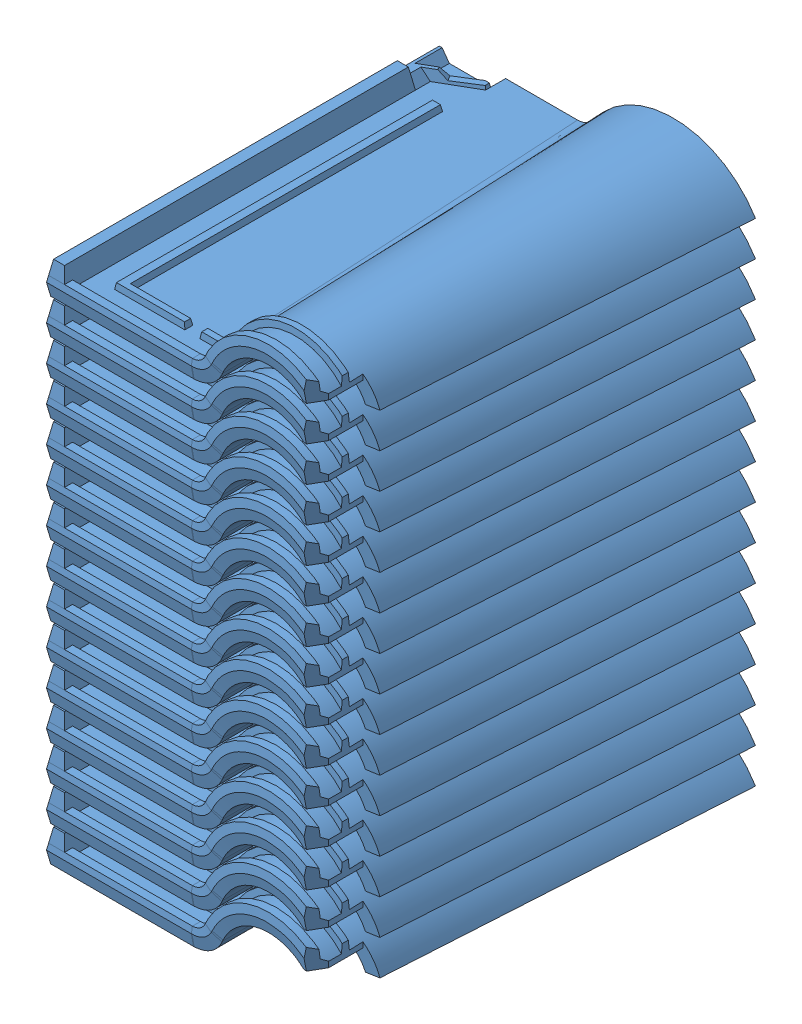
SolidWorks assembly empilage 15 tuiles.SLDASM, configuration Défaut (file format 8000). Lengths in mm.
Overall size (301.93 601.67 406.76).
15 component instances, 1 part files, 3 mates.
Components (placement in the parent):
- tuile_canal_1-1: tuile_canal_1.SLDPRT [Défaut] at (75.9406 -7.5683 406.7628) size (301.93 111.67 406.76)
- tuile_canal_1-2: tuile_canal_1.SLDPRT [Défaut] at (75.9406 -42.5683 406.7628) size (301.93 111.67 406.76)
- tuile_canal_1-3: tuile_canal_1.SLDPRT [Défaut] at (75.9406 -77.5683 406.7628) size (301.93 111.67 406.76)
- tuile_canal_1-4: tuile_canal_1.SLDPRT [Défaut] at (75.9406 -112.5683 406.7628) size (301.93 111.67 406.76)
- tuile_canal_1-5: tuile_canal_1.SLDPRT [Défaut] at (75.9406 -147.5683 406.7628) size (301.93 111.67 406.76)
- tuile_canal_1-6: tuile_canal_1.SLDPRT [Défaut] at (75.9406 -182.5683 406.7628) size (301.93 111.67 406.76)
- tuile_canal_1-7: tuile_canal_1.SLDPRT [Défaut] at (75.9406 -217.5683 406.7628) size (301.93 111.67 406.76)
- tuile_canal_1-8: tuile_canal_1.SLDPRT [Défaut] at (75.9406 -252.5683 406.7628) size (301.93 111.67 406.76)
- tuile_canal_1-9: tuile_canal_1.SLDPRT [Défaut] at (75.9406 -287.5683 406.7628) size (301.93 111.67 406.76)
- tuile_canal_1-10: tuile_canal_1.SLDPRT [Défaut] at (75.9406 -322.5683 406.7628) size (301.93 111.67 406.76)
- tuile_canal_1-11: tuile_canal_1.SLDPRT [Défaut] at (75.9406 -357.5683 406.7628) size (301.93 111.67 406.76)
- tuile_canal_1-12: tuile_canal_1.SLDPRT [Défaut] at (75.9406 -392.5683 406.7628) size (301.93 111.67 406.76)
- tuile_canal_1-13: tuile_canal_1.SLDPRT [Défaut] at (75.9406 -427.5683 406.7628) size (301.93 111.67 406.76)
- tuile_canal_1-14: tuile_canal_1.SLDPRT [Défaut] at (75.9406 -462.5683 406.7628) size (301.93 111.67 406.76)
- tuile_canal_1-15: tuile_canal_1.SLDPRT [Défaut] at (75.9406 -497.5683 406.7628) size (301.93 111.67 406.76)
Mates (geometry in assembly coordinates):
- Coïncidente1: coincident: line of tuile_canal_1-15 through (-143.9591 -485.5683 441.473) axis (0 0 -1); plane of ? through (-143.9591 73.2643 415.941) normal (1 0 0)
- Coïncidente2: coincident: line of tuile_canal_1-1 through (-143.9591 4.4317 441.473) axis (0 0 -1); plane of ? through (-143.9591 73.2643 415.941) normal (1 0 0)
- Distance1: distance = 45 mm anti-aligned: plane of ? through (-143.9591 -526.7357 415.941) normal (0 1 0); plane of tuile_canal_1-15 through (144.0658 -481.7357 36.7628) normal (0 -1 0)
